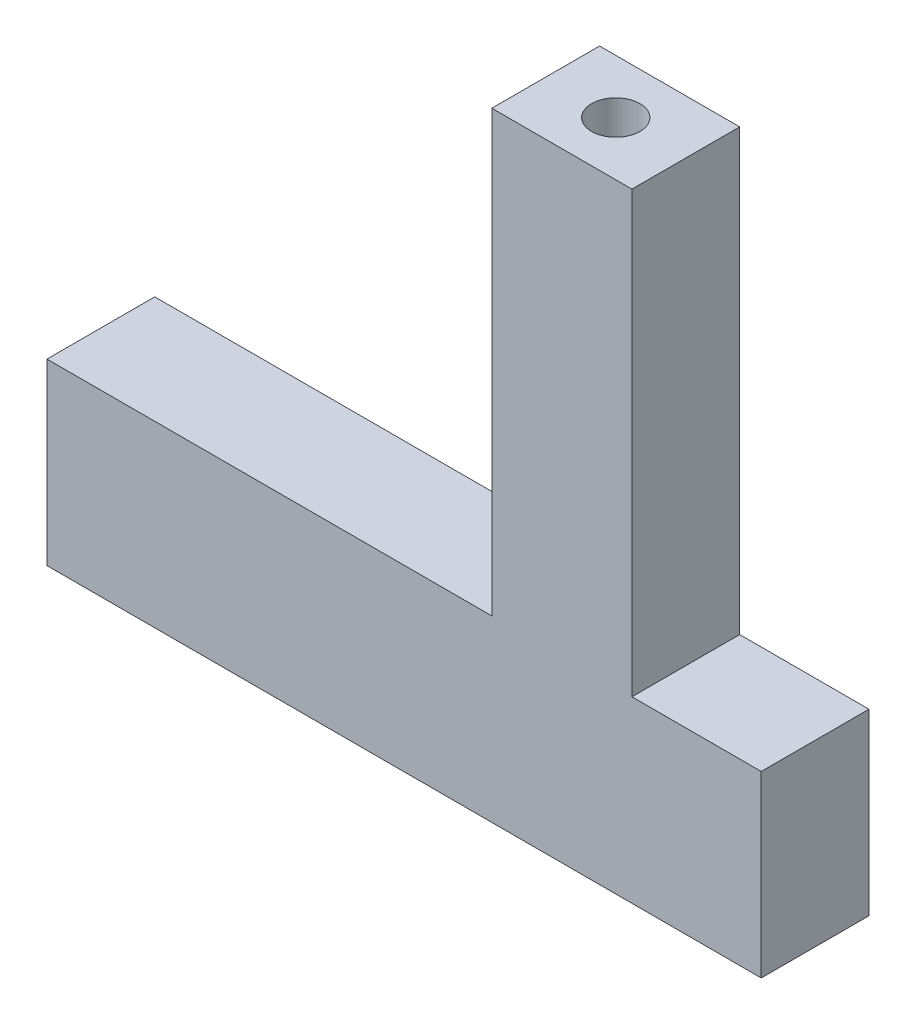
ISO-10303-21;
HEADER;
FILE_DESCRIPTION(('STEP AP214'),'2;1');
FILE_NAME('part.step','',(''),(''),'','','');
FILE_SCHEMA(('AUTOMOTIVE_DESIGN { 1 0 10303 214 1 1 1 1 }'));
ENDSEC;
DATA;
#1=APPLICATION_CONTEXT('core data for automotive mechanical design processes');
#2=APPLICATION_PROTOCOL_DEFINITION('international standard','automotive_design',2000,#1);
#3=PRODUCT_CONTEXT('',#1,'mechanical');
#4=PRODUCT('Part','Part','',(#3));
#5=PRODUCT_RELATED_PRODUCT_CATEGORY('part','',(#4));
#6=PRODUCT_DEFINITION_FORMATION('','',#4);
#7=PRODUCT_DEFINITION_CONTEXT('part definition',#1,'design');
#8=PRODUCT_DEFINITION('design','',#6,#7);
#9=PRODUCT_DEFINITION_SHAPE('','',#8);
#10=(LENGTH_UNIT() NAMED_UNIT(*) SI_UNIT(.MILLI.,.METRE.));
#11=(NAMED_UNIT(*) PLANE_ANGLE_UNIT() SI_UNIT($,.RADIAN.));
#12=(NAMED_UNIT(*) SI_UNIT($,.STERADIAN.) SOLID_ANGLE_UNIT());
#13=UNCERTAINTY_MEASURE_WITH_UNIT(LENGTH_MEASURE(1.E-05),#10,'distance_accuracy_value','');
#14=(GEOMETRIC_REPRESENTATION_CONTEXT(3) GLOBAL_UNCERTAINTY_ASSIGNED_CONTEXT((#13)) GLOBAL_UNIT_ASSIGNED_CONTEXT((#10,
#11,#12)) REPRESENTATION_CONTEXT('',''));
#15=CARTESIAN_POINT('',(0.,0.,0.));
#16=DIRECTION('',(0.,0.,1.));
#17=DIRECTION('',(1.,0.,0.));
#18=AXIS2_PLACEMENT_3D('',#15,#16,#17);
#19=CARTESIAN_POINT('',(-42.0878,10.541,6.35));
#20=DIRECTION('',(1.,0.,0.));
#21=DIRECTION('',(0.,0.,-1.));
#22=AXIS2_PLACEMENT_3D('',#19,#20,#21);
#23=PLANE('',#22);
#24=DIRECTION('',(0.,-1.,0.));
#25=VECTOR('',#24,1.);
#26=CARTESIAN_POINT('',(-42.0878,10.541,0.));
#27=LINE('',#26,#25);
#28=CARTESIAN_POINT('',(-42.0878,10.541,0.));
#29=VERTEX_POINT('',#28);
#30=CARTESIAN_POINT('',(-42.0878,0.,0.));
#31=VERTEX_POINT('',#30);
#32=EDGE_CURVE('E116',#29,#31,#27,.T.);
#33=ORIENTED_EDGE('',*,*,#32,.T.);
#34=DIRECTION('',(0.,0.,-1.));
#35=VECTOR('',#34,1.);
#36=CARTESIAN_POINT('',(-42.0878,0.,6.35));
#37=LINE('',#36,#35);
#38=CARTESIAN_POINT('',(-42.0878,0.,6.35));
#39=VERTEX_POINT('',#38);
#40=EDGE_CURVE('E11',#39,#31,#37,.T.);
#41=ORIENTED_EDGE('',*,*,#40,.F.);
#42=DIRECTION('',(0.,-1.,0.));
#43=VECTOR('',#42,1.);
#44=CARTESIAN_POINT('',(-42.0878,10.541,6.35));
#45=LINE('',#44,#43);
#46=CARTESIAN_POINT('',(-42.0878,10.541,6.35));
#47=VERTEX_POINT('',#46);
#48=EDGE_CURVE('E133',#47,#39,#45,.T.);
#49=ORIENTED_EDGE('',*,*,#48,.F.);
#50=DIRECTION('',(0.,0.,-1.));
#51=VECTOR('',#50,1.);
#52=CARTESIAN_POINT('',(-42.0878,10.541,6.35));
#53=LINE('',#52,#51);
#54=EDGE_CURVE('E147',#47,#29,#53,.T.);
#55=ORIENTED_EDGE('',*,*,#54,.T.);
#56=EDGE_LOOP('',(#33,#41,#49,#55));
#57=FACE_BOUND('',#56,.T.);
#58=ADVANCED_FACE('F31',(#57),#23,.F.);
#59=CARTESIAN_POINT('',(-42.0878,0.,6.35));
#60=DIRECTION('',(0.,1.,0.));
#61=DIRECTION('',(0.,0.,1.));
#62=AXIS2_PLACEMENT_3D('',#59,#60,#61);
#63=PLANE('',#62);
#64=DIRECTION('',(1.,0.,0.));
#65=VECTOR('',#64,1.);
#66=CARTESIAN_POINT('',(-42.0878,0.,0.));
#67=LINE('',#66,#65);
#68=CARTESIAN_POINT('',(0.,0.,0.));
#69=VERTEX_POINT('',#68);
#70=EDGE_CURVE('E119',#31,#69,#67,.T.);
#71=ORIENTED_EDGE('',*,*,#70,.T.);
#72=DIRECTION('',(0.,0.,-1.));
#73=VECTOR('',#72,1.);
#74=CARTESIAN_POINT('',(0.,0.,6.35));
#75=LINE('',#74,#73);
#76=CARTESIAN_POINT('',(0.,0.,6.35));
#77=VERTEX_POINT('',#76);
#78=EDGE_CURVE('E38',#77,#69,#75,.T.);
#79=ORIENTED_EDGE('',*,*,#78,.F.);
#80=DIRECTION('',(1.,0.,0.));
#81=VECTOR('',#80,1.);
#82=CARTESIAN_POINT('',(-42.0878,0.,6.35));
#83=LINE('',#82,#81);
#84=EDGE_CURVE('E135',#39,#77,#83,.T.);
#85=ORIENTED_EDGE('',*,*,#84,.F.);
#86=ORIENTED_EDGE('',*,*,#40,.T.);
#87=EDGE_LOOP('',(#71,#79,#85,#86));
#88=FACE_BOUND('',#87,.T.);
#89=ADVANCED_FACE('F191',(#88),#63,.F.);
#90=CARTESIAN_POINT('',(0.,0.,6.35));
#91=DIRECTION('',(-1.,0.,0.));
#92=DIRECTION('',(0.,0.,1.));
#93=AXIS2_PLACEMENT_3D('',#90,#91,#92);
#94=PLANE('',#93);
#95=DIRECTION('',(0.,1.,0.));
#96=VECTOR('',#95,1.);
#97=CARTESIAN_POINT('',(0.,0.,0.));
#98=LINE('',#97,#96);
#99=CARTESIAN_POINT('',(0.,10.541,0.));
#100=VERTEX_POINT('',#99);
#101=EDGE_CURVE('E121',#69,#100,#98,.T.);
#102=ORIENTED_EDGE('',*,*,#101,.T.);
#103=DIRECTION('',(0.,0.,-1.));
#104=VECTOR('',#103,1.);
#105=CARTESIAN_POINT('',(0.,10.541,6.35));
#106=LINE('',#105,#104);
#107=CARTESIAN_POINT('',(0.,10.541,6.35));
#108=VERTEX_POINT('',#107);
#109=EDGE_CURVE('E162',#108,#100,#106,.T.);
#110=ORIENTED_EDGE('',*,*,#109,.F.);
#111=DIRECTION('',(0.,1.,0.));
#112=VECTOR('',#111,1.);
#113=CARTESIAN_POINT('',(0.,0.,6.35));
#114=LINE('',#113,#112);
#115=EDGE_CURVE('E137',#77,#108,#114,.T.);
#116=ORIENTED_EDGE('',*,*,#115,.F.);
#117=ORIENTED_EDGE('',*,*,#78,.T.);
#118=EDGE_LOOP('',(#102,#110,#116,#117));
#119=FACE_BOUND('',#118,.T.);
#120=ADVANCED_FACE('F169',(#119),#94,.F.);
#121=CARTESIAN_POINT('',(0.,10.541,6.35));
#122=DIRECTION('',(0.,-1.,0.));
#123=DIRECTION('',(0.,0.,-1.));
#124=AXIS2_PLACEMENT_3D('',#121,#122,#123);
#125=PLANE('',#124);
#126=DIRECTION('',(-1.,0.,0.));
#127=VECTOR('',#126,1.);
#128=CARTESIAN_POINT('',(0.,10.541,0.));
#129=LINE('',#128,#127);
#130=CARTESIAN_POINT('',(-7.62000000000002,10.541,0.));
#131=VERTEX_POINT('',#130);
#132=EDGE_CURVE('E123',#100,#131,#129,.T.);
#133=ORIENTED_EDGE('',*,*,#132,.T.);
#134=DIRECTION('',(0.,0.,-1.));
#135=VECTOR('',#134,1.);
#136=CARTESIAN_POINT('',(-7.62000000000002,10.541,6.35));
#137=LINE('',#136,#135);
#138=CARTESIAN_POINT('',(-7.62000000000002,10.541,6.35));
#139=VERTEX_POINT('',#138);
#140=EDGE_CURVE('E159',#139,#131,#137,.T.);
#141=ORIENTED_EDGE('',*,*,#140,.F.);
#142=DIRECTION('',(-1.,0.,0.));
#143=VECTOR('',#142,1.);
#144=CARTESIAN_POINT('',(0.,10.541,6.35));
#145=LINE('',#144,#143);
#146=EDGE_CURVE('E139',#108,#139,#145,.T.);
#147=ORIENTED_EDGE('',*,*,#146,.F.);
#148=ORIENTED_EDGE('',*,*,#109,.T.);
#149=EDGE_LOOP('',(#133,#141,#147,#148));
#150=FACE_BOUND('',#149,.T.);
#151=ADVANCED_FACE('F180',(#150),#125,.F.);
#152=CARTESIAN_POINT('',(-7.62000000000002,10.541,6.35));
#153=DIRECTION('',(-1.,0.,0.));
#154=DIRECTION('',(0.,0.,1.));
#155=AXIS2_PLACEMENT_3D('',#152,#153,#154);
#156=PLANE('',#155);
#157=DIRECTION('',(0.,1.,0.));
#158=VECTOR('',#157,1.);
#159=CARTESIAN_POINT('',(-7.62000000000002,10.541,0.));
#160=LINE('',#159,#158);
#161=CARTESIAN_POINT('',(-7.62000000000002,36.449,0.));
#162=VERTEX_POINT('',#161);
#163=EDGE_CURVE('E125',#131,#162,#160,.T.);
#164=ORIENTED_EDGE('',*,*,#163,.T.);
#165=DIRECTION('',(0.,0.,-1.));
#166=VECTOR('',#165,1.);
#167=CARTESIAN_POINT('',(-7.62000000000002,36.449,6.35));
#168=LINE('',#167,#166);
#169=CARTESIAN_POINT('',(-7.62000000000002,36.449,6.35));
#170=VERTEX_POINT('',#169);
#171=EDGE_CURVE('E156',#170,#162,#168,.T.);
#172=ORIENTED_EDGE('',*,*,#171,.F.);
#173=DIRECTION('',(0.,1.,0.));
#174=VECTOR('',#173,1.);
#175=CARTESIAN_POINT('',(-7.62000000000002,10.541,6.35));
#176=LINE('',#175,#174);
#177=EDGE_CURVE('E141',#139,#170,#176,.T.);
#178=ORIENTED_EDGE('',*,*,#177,.F.);
#179=ORIENTED_EDGE('',*,*,#140,.T.);
#180=EDGE_LOOP('',(#164,#172,#178,#179));
#181=FACE_BOUND('',#180,.T.);
#182=ADVANCED_FACE('F184',(#181),#156,.F.);
#183=CARTESIAN_POINT('',(-7.62000000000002,36.449,6.35));
#184=DIRECTION('',(0.,-1.,0.));
#185=DIRECTION('',(0.,0.,-1.));
#186=AXIS2_PLACEMENT_3D('',#183,#184,#185);
#187=PLANE('',#186);
#188=CARTESIAN_POINT('',(-11.7475,36.449,3.175));
#189=DIRECTION('',(0.,1.,0.));
#190=DIRECTION('',(0.,0.,1.));
#191=AXIS2_PLACEMENT_3D('',#188,#189,#190);
#192=CIRCLE('',#191,1.4224);
#193=CARTESIAN_POINT('',(-11.7475,36.449,4.5974));
#194=VERTEX_POINT('',#193);
#195=EDGE_CURVE('E113',#194,#194,#192,.T.);
#196=ORIENTED_EDGE('',*,*,#195,.F.);
#197=EDGE_LOOP('',(#196));
#198=FACE_BOUND('',#197,.T.);
#199=DIRECTION('',(-1.,0.,0.));
#200=VECTOR('',#199,1.);
#201=CARTESIAN_POINT('',(-7.62000000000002,36.449,0.));
#202=LINE('',#201,#200);
#203=CARTESIAN_POINT('',(-15.875,36.449,0.));
#204=VERTEX_POINT('',#203);
#205=EDGE_CURVE('E127',#162,#204,#202,.T.);
#206=ORIENTED_EDGE('',*,*,#205,.T.);
#207=DIRECTION('',(0.,0.,-1.));
#208=VECTOR('',#207,1.);
#209=CARTESIAN_POINT('',(-15.875,36.449,6.35));
#210=LINE('',#209,#208);
#211=CARTESIAN_POINT('',(-15.875,36.449,6.35));
#212=VERTEX_POINT('',#211);
#213=EDGE_CURVE('E153',#212,#204,#210,.T.);
#214=ORIENTED_EDGE('',*,*,#213,.F.);
#215=DIRECTION('',(-1.,0.,0.));
#216=VECTOR('',#215,1.);
#217=CARTESIAN_POINT('',(-7.62000000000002,36.449,6.35));
#218=LINE('',#217,#216);
#219=EDGE_CURVE('E143',#170,#212,#218,.T.);
#220=ORIENTED_EDGE('',*,*,#219,.F.);
#221=ORIENTED_EDGE('',*,*,#171,.T.);
#222=EDGE_LOOP('',(#206,#214,#220,#221));
#223=FACE_BOUND('',#222,.T.);
#224=ADVANCED_FACE('F200',(#198,#223),#187,.F.);
#225=CARTESIAN_POINT('',(-15.875,36.449,6.35));
#226=DIRECTION('',(1.,0.,0.));
#227=DIRECTION('',(0.,1.,0.));
#228=AXIS2_PLACEMENT_3D('',#225,#226,#227);
#229=PLANE('',#228);
#230=DIRECTION('',(0.,-1.,0.));
#231=VECTOR('',#230,1.);
#232=CARTESIAN_POINT('',(-15.875,36.449,0.));
#233=LINE('',#232,#231);
#234=CARTESIAN_POINT('',(-15.875,10.541,0.));
#235=VERTEX_POINT('',#234);
#236=EDGE_CURVE('E129',#204,#235,#233,.T.);
#237=ORIENTED_EDGE('',*,*,#236,.T.);
#238=DIRECTION('',(0.,0.,-1.));
#239=VECTOR('',#238,1.);
#240=CARTESIAN_POINT('',(-15.875,10.541,6.35));
#241=LINE('',#240,#239);
#242=CARTESIAN_POINT('',(-15.875,10.541,6.35));
#243=VERTEX_POINT('',#242);
#244=EDGE_CURVE('E150',#243,#235,#241,.T.);
#245=ORIENTED_EDGE('',*,*,#244,.F.);
#246=DIRECTION('',(0.,-1.,0.));
#247=VECTOR('',#246,1.);
#248=CARTESIAN_POINT('',(-15.875,36.449,6.35));
#249=LINE('',#248,#247);
#250=EDGE_CURVE('E50',#212,#243,#249,.T.);
#251=ORIENTED_EDGE('',*,*,#250,.F.);
#252=ORIENTED_EDGE('',*,*,#213,.T.);
#253=EDGE_LOOP('',(#237,#245,#251,#252));
#254=FACE_BOUND('',#253,.T.);
#255=ADVANCED_FACE('F198',(#254),#229,.F.);
#256=CARTESIAN_POINT('',(-15.875,10.541,6.35));
#257=DIRECTION('',(0.,-1.,0.));
#258=DIRECTION('',(1.,0.,0.));
#259=AXIS2_PLACEMENT_3D('',#256,#257,#258);
#260=PLANE('',#259);
#261=DIRECTION('',(-1.,0.,0.));
#262=VECTOR('',#261,1.);
#263=CARTESIAN_POINT('',(-15.875,10.541,0.));
#264=LINE('',#263,#262);
#265=EDGE_CURVE('E131',#235,#29,#264,.T.);
#266=ORIENTED_EDGE('',*,*,#265,.T.);
#267=ORIENTED_EDGE('',*,*,#54,.F.);
#268=DIRECTION('',(-1.,0.,0.));
#269=VECTOR('',#268,1.);
#270=CARTESIAN_POINT('',(-15.875,10.541,6.35));
#271=LINE('',#270,#269);
#272=EDGE_CURVE('E45',#243,#47,#271,.T.);
#273=ORIENTED_EDGE('',*,*,#272,.F.);
#274=ORIENTED_EDGE('',*,*,#244,.T.);
#275=EDGE_LOOP('',(#266,#267,#273,#274));
#276=FACE_BOUND('',#275,.T.);
#277=ADVANCED_FACE('F196',(#276),#260,.F.);
#278=CARTESIAN_POINT('',(-42.0878,0.,6.35));
#279=DIRECTION('',(0.,0.,1.));
#280=DIRECTION('',(1.,0.,0.));
#281=AXIS2_PLACEMENT_3D('',#278,#279,#280);
#282=PLANE('',#281);
#283=ORIENTED_EDGE('',*,*,#48,.T.);
#284=ORIENTED_EDGE('',*,*,#84,.T.);
#285=ORIENTED_EDGE('',*,*,#115,.T.);
#286=ORIENTED_EDGE('',*,*,#146,.T.);
#287=ORIENTED_EDGE('',*,*,#177,.T.);
#288=ORIENTED_EDGE('',*,*,#219,.T.);
#289=ORIENTED_EDGE('',*,*,#250,.T.);
#290=ORIENTED_EDGE('',*,*,#272,.T.);
#291=EDGE_LOOP('',(#283,#284,#285,#286,#287,#288,#289,#290));
#292=FACE_BOUND('',#291,.T.);
#293=ADVANCED_FACE('F187',(#292),#282,.T.);
#294=CARTESIAN_POINT('',(-42.0878,0.,0.));
#295=DIRECTION('',(0.,0.,1.));
#296=DIRECTION('',(1.,0.,0.));
#297=AXIS2_PLACEMENT_3D('',#294,#295,#296);
#298=PLANE('',#297);
#299=ORIENTED_EDGE('',*,*,#32,.F.);
#300=ORIENTED_EDGE('',*,*,#265,.F.);
#301=ORIENTED_EDGE('',*,*,#236,.F.);
#302=ORIENTED_EDGE('',*,*,#205,.F.);
#303=ORIENTED_EDGE('',*,*,#163,.F.);
#304=ORIENTED_EDGE('',*,*,#132,.F.);
#305=ORIENTED_EDGE('',*,*,#101,.F.);
#306=ORIENTED_EDGE('',*,*,#70,.F.);
#307=EDGE_LOOP('',(#299,#300,#301,#302,#303,#304,#305,#306));
#308=FACE_BOUND('',#307,.T.);
#309=ADVANCED_FACE('F175',(#308),#298,.F.);
#310=CARTESIAN_POINT('',(-11.7475,36.449,3.175));
#311=DIRECTION('',(0.,1.,0.));
#312=DIRECTION('',(0.,0.,1.));
#313=AXIS2_PLACEMENT_3D('',#310,#311,#312);
#314=CYLINDRICAL_SURFACE('',#313,1.4224);
#315=CARTESIAN_POINT('',(-11.7475,23.749,3.175));
#316=DIRECTION('',(0.,1.,0.));
#317=DIRECTION('',(0.,0.,1.));
#318=AXIS2_PLACEMENT_3D('',#315,#316,#317);
#319=CIRCLE('',#318,1.4224);
#320=CARTESIAN_POINT('',(-11.7475,23.749,4.5974));
#321=VERTEX_POINT('',#320);
#322=EDGE_CURVE('E108',#321,#321,#319,.T.);
#323=ORIENTED_EDGE('',*,*,#322,.F.);
#324=EDGE_LOOP('',(#323));
#325=FACE_BOUND('',#324,.T.);
#326=ORIENTED_EDGE('',*,*,#195,.T.);
#327=EDGE_LOOP('',(#326));
#328=FACE_BOUND('',#327,.T.);
#329=ADVANCED_FACE('F260',(#325,#328),#314,.F.);
#330=CARTESIAN_POINT('',(-10.6172,23.749,3.175));
#331=DIRECTION('',(0.,-1.,0.));
#332=DIRECTION('',(0.,0.,-1.));
#333=AXIS2_PLACEMENT_3D('',#330,#331,#332);
#334=PLANE('',#333);
#335=CARTESIAN_POINT('',(-11.7475,23.749,3.175));
#336=DIRECTION('',(0.,1.,0.));
#337=DIRECTION('',(0.,0.,1.));
#338=AXIS2_PLACEMENT_3D('',#335,#336,#337);
#339=CIRCLE('',#338,1.1303);
#340=CARTESIAN_POINT('',(-11.7475,23.749,4.3053));
#341=VERTEX_POINT('',#340);
#342=EDGE_CURVE('E105',#341,#341,#339,.T.);
#343=ORIENTED_EDGE('',*,*,#342,.F.);
#344=EDGE_LOOP('',(#343));
#345=FACE_BOUND('',#344,.T.);
#346=ORIENTED_EDGE('',*,*,#322,.T.);
#347=EDGE_LOOP('',(#346));
#348=FACE_BOUND('',#347,.T.);
#349=ADVANCED_FACE('F273',(#345,#348),#334,.F.);
#350=CARTESIAN_POINT('',(-11.7475,36.449,3.175));
#351=DIRECTION('',(0.,1.,0.));
#352=DIRECTION('',(0.,0.,1.));
#353=AXIS2_PLACEMENT_3D('',#350,#351,#352);
#354=CYLINDRICAL_SURFACE('',#353,1.1303);
#355=CARTESIAN_POINT('',(-11.7475,21.717,3.175));
#356=DIRECTION('',(0.,1.,0.));
#357=DIRECTION('',(0.,0.,1.));
#358=AXIS2_PLACEMENT_3D('',#355,#356,#357);
#359=CIRCLE('',#358,1.1303);
#360=CARTESIAN_POINT('',(-11.7475,21.717,4.3053));
#361=VERTEX_POINT('',#360);
#362=EDGE_CURVE('E103',#361,#361,#359,.T.);
#363=ORIENTED_EDGE('',*,*,#362,.F.);
#364=EDGE_LOOP('',(#363));
#365=FACE_BOUND('',#364,.T.);
#366=ORIENTED_EDGE('',*,*,#342,.T.);
#367=EDGE_LOOP('',(#366));
#368=FACE_BOUND('',#367,.T.);
#369=ADVANCED_FACE('F99',(#365,#368),#354,.F.);
#370=CARTESIAN_POINT('',(-11.7475,21.717,3.175));
#371=DIRECTION('',(0.,1.,0.));
#372=DIRECTION('',(0.,0.,1.));
#373=AXIS2_PLACEMENT_3D('',#370,#371,#372);
#374=CONICAL_SURFACE('',#373,1.1303,1.02974425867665);
#375=CARTESIAN_POINT('',(-11.7475,21.0378472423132,3.175));
#376=VERTEX_POINT('',#375);
#377=VERTEX_LOOP('',#376);
#378=FACE_BOUND('',#377,.T.);
#379=ORIENTED_EDGE('',*,*,#362,.T.);
#380=EDGE_LOOP('',(#379));
#381=FACE_BOUND('',#380,.T.);
#382=ADVANCED_FACE('F96',(#378,#381),#374,.F.);
#383=CLOSED_SHELL('',(#58,#89,#120,#151,#182,#224,#255,#277,#293,#309,#329,#349,#369,#382));
#384=MANIFOLD_SOLID_BREP('B2',#383);
#385=ADVANCED_BREP_SHAPE_REPRESENTATION('',(#18,#384),#14);
#386=SHAPE_DEFINITION_REPRESENTATION(#9,#385);
ENDSEC;
END-ISO-10303-21;
